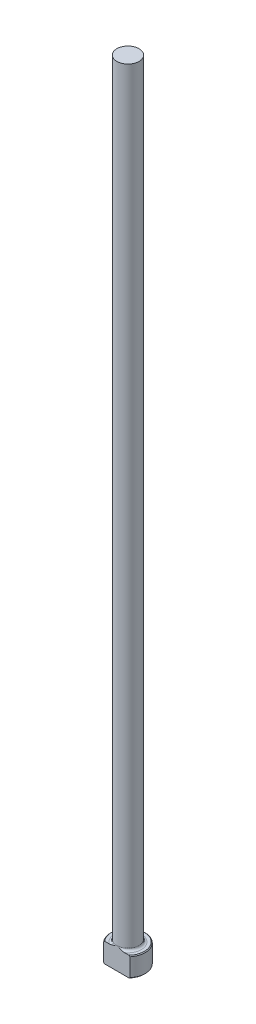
ISO-10303-21;
HEADER;
FILE_DESCRIPTION(('STEP AP214'),'2;1');
FILE_NAME('part.step','',(''),(''),'','','');
FILE_SCHEMA(('AUTOMOTIVE_DESIGN { 1 0 10303 214 1 1 1 1 }'));
ENDSEC;
DATA;
#1=APPLICATION_CONTEXT('core data for automotive mechanical design processes');
#2=APPLICATION_PROTOCOL_DEFINITION('international standard','automotive_design',2000,#1);
#3=PRODUCT_CONTEXT('',#1,'mechanical');
#4=PRODUCT('Part','Part','',(#3));
#5=PRODUCT_RELATED_PRODUCT_CATEGORY('part','',(#4));
#6=PRODUCT_DEFINITION_FORMATION('','',#4);
#7=PRODUCT_DEFINITION_CONTEXT('part definition',#1,'design');
#8=PRODUCT_DEFINITION('design','',#6,#7);
#9=PRODUCT_DEFINITION_SHAPE('','',#8);
#10=(LENGTH_UNIT() NAMED_UNIT(*) SI_UNIT(.MILLI.,.METRE.));
#11=(NAMED_UNIT(*) PLANE_ANGLE_UNIT() SI_UNIT($,.RADIAN.));
#12=(NAMED_UNIT(*) SI_UNIT($,.STERADIAN.) SOLID_ANGLE_UNIT());
#13=UNCERTAINTY_MEASURE_WITH_UNIT(LENGTH_MEASURE(1.E-05),#10,'distance_accuracy_value','');
#14=(GEOMETRIC_REPRESENTATION_CONTEXT(3) GLOBAL_UNCERTAINTY_ASSIGNED_CONTEXT((#13)) GLOBAL_UNIT_ASSIGNED_CONTEXT((#10,
#11,#12)) REPRESENTATION_CONTEXT('',''));
#15=CARTESIAN_POINT('',(0.,0.,0.));
#16=DIRECTION('',(0.,0.,1.));
#17=DIRECTION('',(1.,0.,0.));
#18=AXIS2_PLACEMENT_3D('',#15,#16,#17);
#19=CARTESIAN_POINT('',(0.,0.,0.));
#20=DIRECTION('',(0.,-1.,0.));
#21=DIRECTION('',(0.,0.,-1.));
#22=AXIS2_PLACEMENT_3D('',#19,#20,#21);
#23=PLANE('',#22);
#24=CARTESIAN_POINT('',(0.,0.,0.));
#25=DIRECTION('',(0.,-1.,0.));
#26=DIRECTION('',(0.,0.,-1.));
#27=AXIS2_PLACEMENT_3D('',#24,#25,#26);
#28=CIRCLE('',#27,5.29589999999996);
#29=CARTESIAN_POINT('',(-3.91060119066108,0.,3.57123999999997));
#30=VERTEX_POINT('',#29);
#31=CARTESIAN_POINT('',(3.91060119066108,0.,3.57123999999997));
#32=VERTEX_POINT('',#31);
#33=EDGE_CURVE('E98',#30,#32,#28,.T.);
#34=ORIENTED_EDGE('',*,*,#33,.T.);
#35=DIRECTION('',(-1.,0.,0.));
#36=VECTOR('',#35,1.);
#37=CARTESIAN_POINT('',(-4.24825080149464,0.,3.57123999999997));
#38=LINE('',#37,#36);
#39=EDGE_CURVE('E83',#32,#30,#38,.T.);
#40=ORIENTED_EDGE('',*,*,#39,.T.);
#41=EDGE_LOOP('',(#34,#40));
#42=FACE_BOUND('',#41,.T.);
#43=ADVANCED_FACE('F32',(#42),#23,.T.);
#44=CARTESIAN_POINT('',(0.,259.958771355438,0.));
#45=DIRECTION('',(0.,1.,0.));
#46=DIRECTION('',(0.,0.,1.));
#47=AXIS2_PLACEMENT_3D('',#44,#45,#46);
#48=CYLINDRICAL_SURFACE('',#47,5.54989999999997);
#49=CARTESIAN_POINT('',(0.,6.09600000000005,0.));
#50=DIRECTION('',(0.,1.,0.));
#51=DIRECTION('',(0.,0.,1.));
#52=AXIS2_PLACEMENT_3D('',#49,#50,#51);
#53=CIRCLE('',#52,5.54989999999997);
#54=CARTESIAN_POINT('',(-4.24825080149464,6.09600000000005,3.57123999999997));
#55=VERTEX_POINT('',#54);
#56=CARTESIAN_POINT('',(4.24825080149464,6.09600000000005,3.57123999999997));
#57=VERTEX_POINT('',#56);
#58=EDGE_CURVE('E104',#55,#57,#53,.F.);
#59=ORIENTED_EDGE('',*,*,#58,.T.);
#60=DIRECTION('',(0.,-1.,0.));
#61=VECTOR('',#60,1.);
#62=CARTESIAN_POINT('',(4.24825080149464,254.,3.57123999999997));
#63=LINE('',#62,#61);
#64=CARTESIAN_POINT('',(4.24825080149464,0.253999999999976,3.57123999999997));
#65=VERTEX_POINT('',#64);
#66=EDGE_CURVE('E183',#57,#65,#63,.T.);
#67=ORIENTED_EDGE('',*,*,#66,.T.);
#68=CARTESIAN_POINT('',(0.,0.253999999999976,0.));
#69=DIRECTION('',(0.,-1.,0.));
#70=DIRECTION('',(0.,0.,-1.));
#71=AXIS2_PLACEMENT_3D('',#68,#69,#70);
#72=CIRCLE('',#71,5.54989999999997);
#73=CARTESIAN_POINT('',(-4.24825080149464,0.253999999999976,3.57123999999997));
#74=VERTEX_POINT('',#73);
#75=EDGE_CURVE('E100',#65,#74,#72,.F.);
#76=ORIENTED_EDGE('',*,*,#75,.T.);
#77=DIRECTION('',(0.,-1.,0.));
#78=VECTOR('',#77,1.);
#79=CARTESIAN_POINT('',(-4.24825080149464,254.,3.57123999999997));
#80=LINE('',#79,#78);
#81=EDGE_CURVE('E93',#55,#74,#80,.T.);
#82=ORIENTED_EDGE('',*,*,#81,.F.);
#83=EDGE_LOOP('',(#59,#67,#76,#82));
#84=FACE_BOUND('',#83,.T.);
#85=ADVANCED_FACE('F158',(#84),#48,.T.);
#86=CARTESIAN_POINT('',(-5.54989999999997,6.35,0.));
#87=DIRECTION('',(0.,1.,0.));
#88=DIRECTION('',(0.,0.,1.));
#89=AXIS2_PLACEMENT_3D('',#86,#87,#88);
#90=PLANE('',#89);
#91=CARTESIAN_POINT('',(0.,6.35,0.));
#92=DIRECTION('',(0.,1.,0.));
#93=DIRECTION('',(0.,0.,1.));
#94=AXIS2_PLACEMENT_3D('',#91,#92,#93);
#95=CIRCLE('',#94,5.29590000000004);
#96=CARTESIAN_POINT('',(3.91060119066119,6.35,3.57123999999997));
#97=VERTEX_POINT('',#96);
#98=CARTESIAN_POINT('',(-3.91060119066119,6.35,3.57123999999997));
#99=VERTEX_POINT('',#98);
#100=EDGE_CURVE('E178',#97,#99,#95,.T.);
#101=ORIENTED_EDGE('',*,*,#100,.T.);
#102=DIRECTION('',(1.,0.,0.));
#103=VECTOR('',#102,1.);
#104=CARTESIAN_POINT('',(-5.54989999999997,6.35,3.57123999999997));
#105=LINE('',#104,#103);
#106=CARTESIAN_POINT('',(-2.4542236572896,6.35000000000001,3.57123999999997));
#107=VERTEX_POINT('',#106);
#108=EDGE_CURVE('E57',#99,#107,#105,.T.);
#109=ORIENTED_EDGE('',*,*,#108,.T.);
#110=CARTESIAN_POINT('',(0.,6.35,0.));
#111=DIRECTION('',(0.,1.,0.));
#112=DIRECTION('',(0.,0.,1.));
#113=AXIS2_PLACEMENT_3D('',#110,#111,#112);
#114=CIRCLE('',#113,4.33323999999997);
#115=CARTESIAN_POINT('',(2.45422365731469,6.35000000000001,3.57123999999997));
#116=VERTEX_POINT('',#115);
#117=EDGE_CURVE('E107',#107,#116,#114,.F.);
#118=ORIENTED_EDGE('',*,*,#117,.T.);
#119=EDGE_CURVE('E136',#116,#97,#105,.T.);
#120=ORIENTED_EDGE('',*,*,#119,.T.);
#121=EDGE_LOOP('',(#101,#109,#118,#120));
#122=FACE_BOUND('',#121,.T.);
#123=ADVANCED_FACE('F147',(#122),#90,.T.);
#124=CARTESIAN_POINT('',(0.,6.35000000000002,0.));
#125=DIRECTION('',(0.,-1.,0.));
#126=DIRECTION('',(0.,0.,-1.));
#127=AXIS2_PLACEMENT_3D('',#124,#125,#126);
#128=CONICAL_SURFACE('',#127,5.29590000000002,0.785398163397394);
#129=ORIENTED_EDGE('',*,*,#58,.F.);
#130=CARTESIAN_POINT('',(-9.34862922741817,1.63837165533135,3.57123999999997));
#131=CARTESIAN_POINT('',(-9.20449095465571,1.7730174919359,3.57123999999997));
#132=CARTESIAN_POINT('',(-9.06015748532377,1.90745428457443,3.57123999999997));
#133=CARTESIAN_POINT('',(-8.77103871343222,2.17584295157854,3.57123999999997));
#134=CARTESIAN_POINT('',(-8.62625340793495,2.30979482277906,3.57123999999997));
#135=CARTESIAN_POINT('',(-8.19106245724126,2.71088279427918,3.57123999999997));
#136=CARTESIAN_POINT('',(-7.89988923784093,2.97718811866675,3.57123999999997));
#137=CARTESIAN_POINT('',(-7.31266273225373,3.50875703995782,3.57123999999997));
#138=CARTESIAN_POINT('',(-7.01658928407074,3.77399839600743,3.57123999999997));
#139=CARTESIAN_POINT('',(-6.42070514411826,4.30018345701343,3.57123999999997));
#140=CARTESIAN_POINT('',(-6.12089498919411,4.56112776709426,3.57123999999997));
#141=CARTESIAN_POINT('',(-5.57379517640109,5.02739327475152,3.57123999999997));
#142=CARTESIAN_POINT('',(-5.32743465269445,5.23380250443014,3.57123999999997));
#143=CARTESIAN_POINT('',(-4.82983105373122,5.6408695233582,3.57123999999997));
#144=CARTESIAN_POINT('',(-4.57858641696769,5.84152542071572,3.57123999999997));
#145=CARTESIAN_POINT('',(-4.19689664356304,6.13579820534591,3.57123999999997));
#146=CARTESIAN_POINT('',(-4.06897719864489,6.23268859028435,3.57123999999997));
#147=CARTESIAN_POINT('',(-3.81112388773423,6.42374523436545,3.57123999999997));
#148=CARTESIAN_POINT('',(-3.68119013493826,6.51791164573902,3.57123999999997));
#149=CARTESIAN_POINT('',(-3.41897062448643,6.7027760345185,3.57123999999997));
#150=CARTESIAN_POINT('',(-3.28668612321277,6.7934757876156,3.57123999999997));
#151=CARTESIAN_POINT('',(-3.01922757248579,6.97049297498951,3.57123999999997));
#152=CARTESIAN_POINT('',(-2.88405397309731,7.05681108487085,3.57123999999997));
#153=CARTESIAN_POINT('',(-2.62920774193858,7.21219297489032,3.57123999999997));
#154=CARTESIAN_POINT('',(-2.50998408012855,7.28198981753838,3.57123999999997));
#155=CARTESIAN_POINT('',(-2.26853125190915,7.41625275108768,3.57123999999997));
#156=CARTESIAN_POINT('',(-2.14630175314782,7.48071824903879,3.57123999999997));
#157=CARTESIAN_POINT('',(-1.89852618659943,7.60281435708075,3.57123999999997));
#158=CARTESIAN_POINT('',(-1.77298191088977,7.66044857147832,3.57123999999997));
#159=CARTESIAN_POINT('',(-1.51824567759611,7.76705237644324,3.57123999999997));
#160=CARTESIAN_POINT('',(-1.38905465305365,7.81602416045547,3.57123999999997));
#161=CARTESIAN_POINT('',(-1.15390735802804,7.89415135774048,3.57123999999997));
#162=CARTESIAN_POINT('',(-1.048621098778,7.92531105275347,3.57123999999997));
#163=CARTESIAN_POINT('',(-0.835998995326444,7.97955362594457,3.57123999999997));
#164=CARTESIAN_POINT('',(-0.728663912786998,8.00263944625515,3.57123999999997));
#165=CARTESIAN_POINT('',(-0.512745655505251,8.03960069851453,3.57123999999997));
#166=CARTESIAN_POINT('',(-0.404167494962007,8.05350499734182,3.57123999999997));
#167=CARTESIAN_POINT('',(-0.186191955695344,8.07145854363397,3.57123999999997));
#168=CARTESIAN_POINT('',(-0.0767946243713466,8.07550835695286,3.57123999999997));
#169=CARTESIAN_POINT('',(0.14220663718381,8.07351212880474,3.57123999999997));
#170=CARTESIAN_POINT('',(0.251810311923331,8.06743838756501,3.57123999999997));
#171=CARTESIAN_POINT('',(0.470024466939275,8.0454991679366,3.57123999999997));
#172=CARTESIAN_POINT('',(0.578634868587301,8.02963292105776,3.57123999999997));
#173=CARTESIAN_POINT('',(0.794483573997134,7.98889583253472,3.57123999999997));
#174=CARTESIAN_POINT('',(0.901716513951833,7.96399693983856,3.57123999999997));
#175=CARTESIAN_POINT('',(1.11401362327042,7.9063349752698,3.57123999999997));
#176=CARTESIAN_POINT('',(1.21907768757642,7.87357152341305,3.57123999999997));
#177=CARTESIAN_POINT('',(1.5544253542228,7.75709852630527,3.57123999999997));
#178=CARTESIAN_POINT('',(1.78015988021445,7.66020810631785,3.57123999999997));
#179=CARTESIAN_POINT('',(2.11063839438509,7.49869222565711,3.57123999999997));
#180=CARTESIAN_POINT('',(2.21956521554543,7.44208205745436,3.57123999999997));
#181=CARTESIAN_POINT('',(2.43502073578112,7.32445015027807,3.57123999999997));
#182=CARTESIAN_POINT('',(2.54154973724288,7.26342897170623,3.57123999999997));
#183=CARTESIAN_POINT('',(2.75384117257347,7.13701656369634,3.57123999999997));
#184=CARTESIAN_POINT('',(2.85957563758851,7.0715788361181,3.57123999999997));
#185=CARTESIAN_POINT('',(3.06914141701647,6.93772653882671,3.57123999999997));
#186=CARTESIAN_POINT('',(3.1729726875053,6.86931190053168,3.57123999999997));
#187=CARTESIAN_POINT('',(3.48178799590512,6.66057078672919,3.57123999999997));
#188=CARTESIAN_POINT('',(3.68431418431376,6.51661264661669,3.57123999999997));
#189=CARTESIAN_POINT('',(4.13501059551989,6.18482897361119,3.57123999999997));
#190=CARTESIAN_POINT('',(4.38177575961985,5.99511425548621,3.57123999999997));
#191=CARTESIAN_POINT('',(4.86985386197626,5.60875730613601,3.57123999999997));
#192=CARTESIAN_POINT('',(5.11116579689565,5.41211381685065,3.57123999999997));
#193=CARTESIAN_POINT('',(5.59003172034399,5.01381470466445,3.57123999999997));
#194=CARTESIAN_POINT('',(5.82758147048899,4.81215400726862,3.57123999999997));
#195=CARTESIAN_POINT('',(6.29968686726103,4.40535532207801,3.57123999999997));
#196=CARTESIAN_POINT('',(6.53424243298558,4.20021724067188,3.57123999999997));
#197=CARTESIAN_POINT('',(6.98601923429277,3.80065590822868,3.57123999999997));
#198=CARTESIAN_POINT('',(7.20338349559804,3.60639403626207,3.57123999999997));
#199=CARTESIAN_POINT('',(7.63652694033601,3.21610232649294,3.57123999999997));
#200=CARTESIAN_POINT('',(7.85230608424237,3.02007244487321,3.57123999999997));
#201=CARTESIAN_POINT('',(8.28210401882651,2.62706235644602,3.57123999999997));
#202=CARTESIAN_POINT('',(8.49612567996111,2.43008528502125,3.57123999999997));
#203=CARTESIAN_POINT('',(8.92311188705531,2.03500873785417,3.57123999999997));
#204=CARTESIAN_POINT('',(9.13607648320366,1.83690931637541,3.57123999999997));
#205=CARTESIAN_POINT('',(9.34862922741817,1.63837165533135,3.57123999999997));
#206=B_SPLINE_CURVE_WITH_KNOTS('',3,(#130,#131,#132,#133,#134,#135,#136,#137,#138,#139,#140,
#141,#142,#143,#144,#145,#146,#147,#148,#149,#150,#151,#152,#153,#154,#155,#156,#157,#158,#159,
#160,#161,#162,#163,#164,#165,#166,#167,#168,#169,#170,#171,#172,#173,#174,#175,#176,#177,#178,
#179,#180,#181,#182,#183,#184,#185,#186,#187,#188,#189,#190,#191,#192,#193,#194,#195,#196,#197,
#198,#199,#200,#201,#202,#203,#204,#205),.UNSPECIFIED.,.F.,.F.,(4,2,2,2,2,2,2,2,2,2,2,2,2,2,2,2,
2,2,2,2,2,2,2,2,2,2,2,2,2,2,2,2,2,2,2,2,2,4),(0.,0.591732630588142,1.18346911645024,
2.36721926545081,3.55971708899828,4.75204551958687,5.7161943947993,6.68065676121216,
7.16204440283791,7.64340508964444,8.12451581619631,8.60555213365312,9.01990095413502,
9.43429579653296,9.84847101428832,10.2625412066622,10.5916729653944,10.9206846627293,
11.2486569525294,11.5766104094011,11.9054626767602,12.2343407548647,12.5642490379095,
12.8941732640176,13.628955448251,13.9971988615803,14.3653955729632,14.7383788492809,
15.1113707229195,15.8565801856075,16.7901898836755,17.7239699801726,18.6587363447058,
19.5935279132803,20.4680812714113,21.3426563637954,22.215261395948,23.0878245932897),.UNSPECIFIED.);
#207=EDGE_CURVE('E135',#55,#99,#206,.T.);
#208=ORIENTED_EDGE('',*,*,#207,.T.);
#209=ORIENTED_EDGE('',*,*,#100,.F.);
#210=EDGE_CURVE('E127',#97,#57,#206,.T.);
#211=ORIENTED_EDGE('',*,*,#210,.T.);
#212=EDGE_LOOP('',(#129,#208,#209,#211));
#213=FACE_BOUND('',#212,.T.);
#214=ADVANCED_FACE('F143',(#213),#128,.T.);
#215=CARTESIAN_POINT('',(0.,0.253999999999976,0.));
#216=DIRECTION('',(0.,1.,0.));
#217=DIRECTION('',(0.,0.,1.));
#218=AXIS2_PLACEMENT_3D('',#215,#216,#217);
#219=CONICAL_SURFACE('',#218,5.54989999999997,0.785398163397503);
#220=ORIENTED_EDGE('',*,*,#75,.F.);
#221=CARTESIAN_POINT('',(9.34862922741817,4.7116283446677,3.57123999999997));
#222=CARTESIAN_POINT('',(9.20449095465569,4.57698250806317,3.57123999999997));
#223=CARTESIAN_POINT('',(9.06015748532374,4.44254571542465,3.57123999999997));
#224=CARTESIAN_POINT('',(8.77103871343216,4.17415704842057,3.57123999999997));
#225=CARTESIAN_POINT('',(8.62625340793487,4.04020517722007,3.57123999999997));
#226=CARTESIAN_POINT('',(8.19106245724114,3.63911720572,3.57123999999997));
#227=CARTESIAN_POINT('',(7.89988923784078,3.37281188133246,3.57123999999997));
#228=CARTESIAN_POINT('',(7.31266273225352,2.84124296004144,3.57123999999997));
#229=CARTESIAN_POINT('',(7.01658928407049,2.57600160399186,3.57123999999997));
#230=CARTESIAN_POINT('',(6.42070514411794,2.04981654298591,3.57123999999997));
#231=CARTESIAN_POINT('',(6.12089498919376,1.78887223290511,3.57123999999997));
#232=CARTESIAN_POINT('',(5.57379517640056,1.32260672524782,3.57123999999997));
#233=CARTESIAN_POINT('',(5.32743465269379,1.11619749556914,3.57123999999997));
#234=CARTESIAN_POINT('',(4.82983105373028,0.709130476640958,3.57123999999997));
#235=CARTESIAN_POINT('',(4.5785864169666,0.508474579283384,3.57123999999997));
#236=CARTESIAN_POINT('',(4.19689664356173,0.214201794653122,3.57123999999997));
#237=CARTESIAN_POINT('',(4.06897719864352,0.117311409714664,3.57123999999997));
#238=CARTESIAN_POINT('',(3.8111238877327,-0.0737452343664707,3.57123999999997));
#239=CARTESIAN_POINT('',(3.68119013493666,-0.167911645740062,3.57123999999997));
#240=CARTESIAN_POINT('',(3.41897062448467,-0.352776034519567,3.57123999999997));
#241=CARTESIAN_POINT('',(3.28668612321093,-0.443475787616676,3.57123999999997));
#242=CARTESIAN_POINT('',(3.01922757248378,-0.620492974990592,3.57123999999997));
#243=CARTESIAN_POINT('',(2.88405397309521,-0.706811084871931,3.57123999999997));
#244=CARTESIAN_POINT('',(2.6292077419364,-0.86219297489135,3.57123999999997));
#245=CARTESIAN_POINT('',(2.50998408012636,-0.931989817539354,3.57123999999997));
#246=CARTESIAN_POINT('',(2.26853125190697,-1.06625275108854,3.57123999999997));
#247=CARTESIAN_POINT('',(2.14630175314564,-1.13071824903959,3.57123999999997));
#248=CARTESIAN_POINT('',(1.89852618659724,-1.25281435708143,3.57123999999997));
#249=CARTESIAN_POINT('',(1.77298191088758,-1.31044857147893,3.57123999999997));
#250=CARTESIAN_POINT('',(1.51824567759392,-1.41705237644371,3.57123999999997));
#251=CARTESIAN_POINT('',(1.38905465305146,-1.46602416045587,3.57123999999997));
#252=CARTESIAN_POINT('',(1.15390735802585,-1.54415135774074,3.57123999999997));
#253=CARTESIAN_POINT('',(1.04862109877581,-1.57531105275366,3.57123999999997));
#254=CARTESIAN_POINT('',(0.835998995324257,-1.62955362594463,3.57123999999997));
#255=CARTESIAN_POINT('',(0.728663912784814,-1.65263944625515,3.57123999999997));
#256=CARTESIAN_POINT('',(0.512745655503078,-1.68960069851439,3.57123999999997));
#257=CARTESIAN_POINT('',(0.404167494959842,-1.70350499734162,3.57123999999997));
#258=CARTESIAN_POINT('',(0.186191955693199,-1.72145854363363,3.57123999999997));
#259=CARTESIAN_POINT('',(0.0767946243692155,-1.72550835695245,3.57123999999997));
#260=CARTESIAN_POINT('',(-0.142206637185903,-1.7235121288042,3.57123999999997));
#261=CARTESIAN_POINT('',(-0.251810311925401,-1.71743838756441,3.57123999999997));
#262=CARTESIAN_POINT('',(-0.470024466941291,-1.69549916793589,3.57123999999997));
#263=CARTESIAN_POINT('',(-0.578634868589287,-1.679632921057,3.57123999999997));
#264=CARTESIAN_POINT('',(-0.794483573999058,-1.63889583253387,3.57123999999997));
#265=CARTESIAN_POINT('',(-0.901716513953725,-1.61399693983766,3.57123999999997));
#266=CARTESIAN_POINT('',(-1.11401362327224,-1.55633497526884,3.57123999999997));
#267=CARTESIAN_POINT('',(-1.21907768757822,-1.52357152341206,3.57123999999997));
#268=CARTESIAN_POINT('',(-1.55442535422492,-1.40709852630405,3.57123999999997));
#269=CARTESIAN_POINT('',(-1.78015988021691,-1.3102081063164,3.57123999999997));
#270=CARTESIAN_POINT('',(-2.11063839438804,-1.14869222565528,3.57123999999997));
#271=CARTESIAN_POINT('',(-2.21956521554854,-1.09208205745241,3.57123999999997));
#272=CARTESIAN_POINT('',(-2.43502073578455,-0.974450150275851,3.57123999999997));
#273=CARTESIAN_POINT('',(-2.54154973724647,-0.913428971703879,3.57123999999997));
#274=CARTESIAN_POINT('',(-2.75384117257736,-0.787016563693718,3.57123999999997));
#275=CARTESIAN_POINT('',(-2.85957563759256,-0.721578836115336,3.57123999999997));
#276=CARTESIAN_POINT('',(-3.06914141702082,-0.58772653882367,3.57123999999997));
#277=CARTESIAN_POINT('',(-3.1729726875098,-0.519311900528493,3.57123999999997));
#278=CARTESIAN_POINT('',(-3.48178799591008,-0.310570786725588,3.57123999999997));
#279=CARTESIAN_POINT('',(-3.68431418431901,-0.166612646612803,3.57123999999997));
#280=CARTESIAN_POINT('',(-4.13501059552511,0.165171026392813,3.57123999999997));
#281=CARTESIAN_POINT('',(-4.38177575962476,0.354885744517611,3.57123999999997));
#282=CARTESIAN_POINT('',(-4.86985386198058,0.741242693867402,3.57123999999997));
#283=CARTESIAN_POINT('',(-5.11116579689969,0.937886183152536,3.57123999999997));
#284=CARTESIAN_POINT('',(-5.59003172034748,1.33618529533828,3.57123999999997));
#285=CARTESIAN_POINT('',(-5.8275814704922,1.53784599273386,3.57123999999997));
#286=CARTESIAN_POINT('',(-6.29968686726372,1.94464467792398,3.57123999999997));
#287=CARTESIAN_POINT('',(-6.534242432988,2.14978275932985,3.57123999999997));
#288=CARTESIAN_POINT('',(-6.98601923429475,2.5493440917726,3.57123999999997));
#289=CARTESIAN_POINT('',(-7.20338349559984,2.74360596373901,3.57123999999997));
#290=CARTESIAN_POINT('',(-7.63652694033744,3.13389767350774,3.57123999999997));
#291=CARTESIAN_POINT('',(-7.85230608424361,3.32992755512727,3.57123999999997));
#292=CARTESIAN_POINT('',(-8.28210401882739,3.72293764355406,3.57123999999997));
#293=CARTESIAN_POINT('',(-8.49612567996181,3.91991471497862,3.57123999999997));
#294=CARTESIAN_POINT('',(-8.92311188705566,4.31499126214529,3.57123999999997));
#295=CARTESIAN_POINT('',(-9.13607648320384,4.51309068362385,3.57123999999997));
#296=CARTESIAN_POINT('',(-9.34862922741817,4.7116283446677,3.57123999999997));
#297=B_SPLINE_CURVE_WITH_KNOTS('',3,(#221,#222,#223,#224,#225,#226,#227,#228,#229,#230,#231,
#232,#233,#234,#235,#236,#237,#238,#239,#240,#241,#242,#243,#244,#245,#246,#247,#248,#249,#250,
#251,#252,#253,#254,#255,#256,#257,#258,#259,#260,#261,#262,#263,#264,#265,#266,#267,#268,#269,
#270,#271,#272,#273,#274,#275,#276,#277,#278,#279,#280,#281,#282,#283,#284,#285,#286,#287,#288,
#289,#290,#291,#292,#293,#294,#295,#296),.UNSPECIFIED.,.F.,.F.,(4,2,2,2,2,2,2,2,2,2,2,2,2,2,2,2,
2,2,2,2,2,2,2,2,2,2,2,2,2,2,2,2,2,2,2,2,2,4),(0.,0.591732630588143,1.18346911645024,
2.36721926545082,3.55971708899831,4.75204551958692,5.71619439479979,6.68065676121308,
7.16204440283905,7.64340508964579,8.12451581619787,8.6055521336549,9.01990095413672,
9.43429579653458,9.84847101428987,10.2625412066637,10.5916729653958,10.9206846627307,
11.2486569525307,11.5766104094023,11.9054626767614,12.2343407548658,12.5642490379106,
12.8941732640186,13.6289554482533,13.9971988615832,14.3653955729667,14.7383788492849,
15.1113707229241,15.8565801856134,16.7901898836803,17.7239699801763,18.6587363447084,
19.5935279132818,20.4680812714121,21.3426563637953,22.2152613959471,23.087824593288),.UNSPECIFIED.);
#298=EDGE_CURVE('E86',#65,#32,#297,.T.);
#299=ORIENTED_EDGE('',*,*,#298,.T.);
#300=ORIENTED_EDGE('',*,*,#33,.F.);
#301=EDGE_CURVE('E89',#30,#74,#297,.T.);
#302=ORIENTED_EDGE('',*,*,#301,.T.);
#303=EDGE_LOOP('',(#220,#299,#300,#302));
#304=FACE_BOUND('',#303,.T.);
#305=ADVANCED_FACE('F97',(#304),#219,.T.);
#306=CARTESIAN_POINT('',(0.,7.11200000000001,0.));
#307=DIRECTION('',(0.,1.,0.));
#308=DIRECTION('',(0.,0.,1.));
#309=AXIS2_PLACEMENT_3D('',#306,#307,#308);
#310=TOROIDAL_SURFACE('',#309,4.33323999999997,0.762);
#311=CARTESIAN_POINT('',(0.,7.11200000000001,3.57123999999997));
#312=CARTESIAN_POINT('',(-5.01521697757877E-13,7.11200100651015,3.57123999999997));
#313=CARTESIAN_POINT('',(1.76590739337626E-07,7.11200201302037,3.57123999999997));
#314=CARTESIAN_POINT('',(7.55286765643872E-07,7.11200396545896,3.57123999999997));
#315=CARTESIAN_POINT('',(1.16131545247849E-06,7.11200491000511,3.57123999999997));
#316=CARTESIAN_POINT('',(2.14347150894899E-06,7.1120067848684,3.57123999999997));
#317=CARTESIAN_POINT('',(2.72908456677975E-06,7.1120077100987,3.57123999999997));
#318=CARTESIAN_POINT('',(4.00559807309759E-06,7.11200947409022,3.57123999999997));
#319=CARTESIAN_POINT('',(4.69593042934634E-06,7.11201031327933,3.57123999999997));
#320=CARTESIAN_POINT('',(7.12798779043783E-06,7.1120130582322,3.57123999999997));
#321=CARTESIAN_POINT('',(9.00885578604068E-06,7.11201484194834,3.57123999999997));
#322=CARTESIAN_POINT('',(1.29410398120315E-05,7.11201807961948,3.57123999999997));
#323=CARTESIAN_POINT('',(1.49866128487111E-05,7.11201954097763,3.57123999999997));
#324=CARTESIAN_POINT('',(2.27853159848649E-05,7.11202486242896,3.57123999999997));
#325=CARTESIAN_POINT('',(2.87443387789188E-05,7.11202843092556,3.57123999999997));
#326=CARTESIAN_POINT('',(4.06410352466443E-05,7.11203442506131,3.57123999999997));
#327=CARTESIAN_POINT('',(4.65470368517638E-05,7.11203691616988,3.57123999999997));
#328=CARTESIAN_POINT('',(7.11711037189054E-05,7.11204719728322,3.57123999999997));
#329=CARTESIAN_POINT('',(8.99605831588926E-05,7.11205478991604,3.57123999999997));
#330=CARTESIAN_POINT('',(0.00012545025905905,7.11206727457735,3.57123999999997));
#331=CARTESIAN_POINT('',(0.000142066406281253,7.1120723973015,3.57123999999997));
#332=CARTESIAN_POINT('',(0.000260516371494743,7.11211213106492,3.57123999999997));
#333=CARTESIAN_POINT('',(0.00035660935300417,7.1121616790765,3.57123999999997));
#334=CARTESIAN_POINT('',(0.000727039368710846,7.1123455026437,3.57123999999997));
#335=CARTESIAN_POINT('',(0.001005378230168,7.11246868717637,3.57123999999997));
#336=CARTESIAN_POINT('',(0.00207465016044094,7.11294918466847,3.57123999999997));
#337=CARTESIAN_POINT('',(0.00286145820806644,7.11331811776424,3.57123999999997));
#338=CARTESIAN_POINT('',(0.00604597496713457,7.11480388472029,3.57123999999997));
#339=CARTESIAN_POINT('',(0.00844825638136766,7.11590763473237,3.57123999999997));
#340=CARTESIAN_POINT('',(0.0421206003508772,7.13138817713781,3.57123999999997));
#341=CARTESIAN_POINT('',(0.0733565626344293,7.1458632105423,3.57123999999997));
#342=CARTESIAN_POINT('',(0.136296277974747,7.1749208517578,3.57123999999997));
#343=CARTESIAN_POINT('',(0.168000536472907,7.18950218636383,3.57123999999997));
#344=CARTESIAN_POINT('',(0.26049771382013,7.23192483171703,3.57123999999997));
#345=CARTESIAN_POINT('',(0.321333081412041,7.2596772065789,3.57123999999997));
#346=CARTESIAN_POINT('',(0.450063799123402,7.3176989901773,3.57123999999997));
#347=CARTESIAN_POINT('',(0.517988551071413,7.34790319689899,3.57123999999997));
#348=CARTESIAN_POINT('',(0.654961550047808,7.40755967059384,3.57123999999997));
#349=CARTESIAN_POINT('',(0.724014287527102,7.4370016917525,3.57123999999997));
#350=CARTESIAN_POINT('',(0.845579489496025,7.48730903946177,3.57123999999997));
#351=CARTESIAN_POINT('',(0.897958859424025,7.5084946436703,3.57123999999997));
#352=CARTESIAN_POINT('',(1.00299625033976,7.54979079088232,3.57123999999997));
#353=CARTESIAN_POINT('',(1.05565332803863,7.56990374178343,3.57123999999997));
#354=CARTESIAN_POINT('',(1.21212759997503,7.62761302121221,3.57123999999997));
#355=CARTESIAN_POINT('',(1.31659809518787,7.66348622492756,3.57123999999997));
#356=CARTESIAN_POINT('',(1.49278330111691,7.71807663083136,3.57123999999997));
#357=CARTESIAN_POINT('',(1.56395183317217,7.73855254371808,3.57123999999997));
#358=CARTESIAN_POINT('',(1.70759150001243,7.77611793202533,3.57123999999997));
#359=CARTESIAN_POINT('',(1.78006754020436,7.79318887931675,3.57123999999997));
#360=CARTESIAN_POINT('',(1.9296081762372,7.82384868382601,3.57123999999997));
#361=CARTESIAN_POINT('',(2.00671897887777,7.83721686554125,3.57123999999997));
#362=CARTESIAN_POINT('',(2.16170557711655,7.85827154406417,3.57123999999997));
#363=CARTESIAN_POINT('',(2.23958110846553,7.86595993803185,3.57123999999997));
#364=CARTESIAN_POINT('',(2.41316458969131,7.87541912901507,3.57123999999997));
#365=CARTESIAN_POINT('',(2.50897971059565,7.87548974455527,3.57123999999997));
#366=CARTESIAN_POINT('',(2.69873879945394,7.86266617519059,3.57123999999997));
#367=CARTESIAN_POINT('',(2.79269122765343,7.84993298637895,3.57123999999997));
#368=CARTESIAN_POINT('',(2.94834629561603,7.81478970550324,3.57123999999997));
#369=CARTESIAN_POINT('',(3.01099313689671,7.79661956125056,3.57123999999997));
#370=CARTESIAN_POINT('',(3.13311783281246,7.75119466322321,3.57123999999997));
#371=CARTESIAN_POINT('',(3.19259303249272,7.72393243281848,3.57123999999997));
#372=CARTESIAN_POINT('',(3.2895229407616,7.66822810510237,3.57123999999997));
#373=CARTESIAN_POINT('',(3.32843006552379,7.64232613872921,3.57123999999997));
#374=CARTESIAN_POINT('',(3.40175541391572,7.58480019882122,3.57123999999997));
#375=CARTESIAN_POINT('',(3.43618193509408,7.55318706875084,3.57123999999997));
#376=CARTESIAN_POINT('',(3.49199473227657,7.49158316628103,3.57123999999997));
#377=CARTESIAN_POINT('',(3.5145944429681,7.4626970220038,3.57123999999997));
#378=CARTESIAN_POINT('',(3.55479974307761,7.40160169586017,3.57123999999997));
#379=CARTESIAN_POINT('',(3.57240720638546,7.36939376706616,3.57123999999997));
#380=CARTESIAN_POINT('',(3.60162953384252,7.30200115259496,3.57123999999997));
#381=CARTESIAN_POINT('',(3.61319239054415,7.26679356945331,3.57123999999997));
#382=CARTESIAN_POINT('',(3.62914546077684,7.19478844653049,3.57123999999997));
#383=CARTESIAN_POINT('',(3.63354215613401,7.15799237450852,3.57123999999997));
#384=CARTESIAN_POINT('',(3.6347021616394,7.08938239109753,3.57123999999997));
#385=CARTESIAN_POINT('',(3.63243477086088,7.05758138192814,3.57123999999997));
#386=CARTESIAN_POINT('',(3.62246065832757,6.99485289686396,3.57123999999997));
#387=CARTESIAN_POINT('',(3.614754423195,6.96392534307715,3.57123999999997));
#388=CARTESIAN_POINT('',(3.59460534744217,6.90439360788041,3.57123999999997));
#389=CARTESIAN_POINT('',(3.5822644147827,6.87575447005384,3.57123999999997));
#390=CARTESIAN_POINT('',(3.55348648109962,6.82063145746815,3.57123999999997));
#391=CARTESIAN_POINT('',(3.53704806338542,6.79414833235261,3.57123999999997));
#392=CARTESIAN_POINT('',(3.49338312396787,6.73337952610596,3.57123999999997));
#393=CARTESIAN_POINT('',(3.4644863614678,6.70029184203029,3.57123999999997));
#394=CARTESIAN_POINT('',(3.40170527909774,6.63922321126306,3.57123999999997));
#395=CARTESIAN_POINT('',(3.3678091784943,6.61125468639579,3.57123999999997));
#396=CARTESIAN_POINT('',(3.28195465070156,6.54991490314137,3.57123999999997));
#397=CARTESIAN_POINT('',(3.22826146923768,6.51898089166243,3.57123999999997));
#398=CARTESIAN_POINT('',(3.11685649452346,6.4659881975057,3.57123999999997));
#399=CARTESIAN_POINT('',(3.05914651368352,6.44392554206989,3.57123999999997));
#400=CARTESIAN_POINT('',(2.90895675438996,6.397325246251,3.57123999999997));
#401=CARTESIAN_POINT('',(2.81483745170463,6.37812048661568,3.57123999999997));
#402=CARTESIAN_POINT('',(2.62379203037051,6.35393265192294,3.57123999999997));
#403=CARTESIAN_POINT('',(2.52684524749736,6.34914127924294,3.57123999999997));
#404=CARTESIAN_POINT('',(2.34175764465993,6.35101691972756,3.57123999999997));
#405=CARTESIAN_POINT('',(2.25359864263,6.35670506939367,3.57123999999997));
#406=CARTESIAN_POINT('',(2.07796266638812,6.37582328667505,3.57123999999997));
#407=CARTESIAN_POINT('',(1.99048774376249,6.38927124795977,3.57123999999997));
#408=CARTESIAN_POINT('',(1.82119356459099,6.42156125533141,3.57123999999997));
#409=CARTESIAN_POINT('',(1.73931346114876,6.4400930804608,3.57123999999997));
#410=CARTESIAN_POINT('',(1.57721134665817,6.48159818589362,3.57123999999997));
#411=CARTESIAN_POINT('',(1.4969824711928,6.50454506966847,3.57123999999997));
#412=CARTESIAN_POINT('',(1.31237017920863,6.56193110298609,3.57123999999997));
#413=CARTESIAN_POINT('',(1.20840446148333,6.59770595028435,3.57123999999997));
#414=CARTESIAN_POINT('',(1.05265881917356,6.6552295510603,3.57123999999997));
#415=CARTESIAN_POINT('',(1.00023402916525,6.67527678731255,3.57123999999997));
#416=CARTESIAN_POINT('',(0.895657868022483,6.71642939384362,3.57123999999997));
#417=CARTESIAN_POINT('',(0.843507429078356,6.7375371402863,3.57123999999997));
#418=CARTESIAN_POINT('',(0.7223348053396,6.78770883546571,3.57123999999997));
#419=CARTESIAN_POINT('',(0.653445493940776,6.81709241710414,3.57123999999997));
#420=CARTESIAN_POINT('',(0.516794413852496,6.87662522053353,3.57123999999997));
#421=CARTESIAN_POINT('',(0.449028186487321,6.90676427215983,3.57123999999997));
#422=CARTESIAN_POINT('',(0.320599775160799,6.96465641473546,3.57123999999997));
#423=CARTESIAN_POINT('',(0.25990837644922,6.99234472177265,3.57123999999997));
#424=CARTESIAN_POINT('',(0.167629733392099,7.03466840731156,3.57123999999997));
#425=CARTESIAN_POINT('',(0.136000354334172,7.04921552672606,3.57123999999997));
#426=CARTESIAN_POINT('',(0.0732091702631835,7.07820481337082,3.57123999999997));
#427=CARTESIAN_POINT('',(0.0420468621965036,7.09264571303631,3.57123999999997));
#428=CARTESIAN_POINT('',(0.00844824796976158,7.10809236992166,3.57123999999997));
#429=CARTESIAN_POINT('',(0.00604595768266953,7.10919612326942,3.57123999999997));
#430=CARTESIAN_POINT('',(0.00286143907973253,7.11068189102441,3.57123999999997));
#431=CARTESIAN_POINT('',(0.00207463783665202,7.11105082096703,3.57123999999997));
#432=CARTESIAN_POINT('',(0.00100537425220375,7.11153131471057,3.57123999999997));
#433=CARTESIAN_POINT('',(0.000727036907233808,7.11165449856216,3.57123999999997));
#434=CARTESIAN_POINT('',(0.000356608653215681,7.11183832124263,3.57123999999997));
#435=CARTESIAN_POINT('',(0.000260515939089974,7.11188786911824,3.57123999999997));
#436=CARTESIAN_POINT('',(0.000142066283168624,7.1119276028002,3.57123999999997));
#437=CARTESIAN_POINT('',(0.000125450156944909,7.1119327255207,3.57123999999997));
#438=CARTESIAN_POINT('',(8.99605261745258E-05,7.1119452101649,3.57123999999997));
#439=CARTESIAN_POINT('',(7.11710702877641E-05,7.11195280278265,3.57123999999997));
#440=CARTESIAN_POINT('',(4.65470297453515E-05,7.11196308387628,3.57123999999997));
#441=CARTESIAN_POINT('',(4.06410314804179E-05,7.11196557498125,3.57123999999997));
#442=CARTESIAN_POINT('',(2.87443410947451E-05,7.11197156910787,3.57123999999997));
#443=CARTESIAN_POINT('',(2.27853209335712E-05,7.11197513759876,3.57123999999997));
#444=CARTESIAN_POINT('',(1.49866201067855E-05,7.11198045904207,3.57123999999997));
#445=CARTESIAN_POINT('',(1.29410472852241E-05,7.11198192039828,3.57123999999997));
#446=CARTESIAN_POINT('',(9.00886329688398E-06,7.11198515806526,3.57123999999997));
#447=CARTESIAN_POINT('',(7.12799510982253E-06,7.11198694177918,3.57123999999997));
#448=CARTESIAN_POINT('',(4.69593701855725E-06,7.11198968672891,3.57123999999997));
#449=CARTESIAN_POINT('',(4.00560436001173E-06,7.11199052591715,3.57123999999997));
#450=CARTESIAN_POINT('',(2.72909009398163E-06,7.1119922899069,3.57123999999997));
#451=CARTESIAN_POINT('',(2.1434765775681E-06,7.11199321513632,3.57123999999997));
#452=CARTESIAN_POINT('',(1.16131942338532E-06,7.11199508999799,3.57123999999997));
#453=CARTESIAN_POINT('',(7.55290113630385E-07,7.11199603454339,3.57123999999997));
#454=CARTESIAN_POINT('',(1.76592600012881E-07,7.11199798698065,3.57123999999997));
#455=CARTESIAN_POINT('',(5.01521491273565E-13,7.11199899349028,3.57123999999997));
#456=CARTESIAN_POINT('',(0.,7.11200000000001,3.57123999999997));
#457=B_SPLINE_CURVE_WITH_KNOTS('',3,(#311,#312,#313,#314,#315,#316,#317,#318,#319,#320,#321,
#322,#323,#324,#325,#326,#327,#328,#329,#330,#331,#332,#333,#334,#335,#336,#337,#338,#339,#340,
#341,#342,#343,#344,#345,#346,#347,#348,#349,#350,#351,#352,#353,#354,#355,#356,#357,#358,#359,
#360,#361,#362,#363,#364,#365,#366,#367,#368,#369,#370,#371,#372,#373,#374,#375,#376,#377,#378,
#379,#380,#381,#382,#383,#384,#385,#386,#387,#388,#389,#390,#391,#392,#393,#394,#395,#396,#397,
#398,#399,#400,#401,#402,#403,#404,#405,#406,#407,#408,#409,#410,#411,#412,#413,#414,#415,#416,
#417,#418,#419,#420,#421,#422,#423,#424,#425,#426,#427,#428,#429,#430,#431,#432,#433,#434,#435,
#436,#437,#438,#439,#440,#441,#442,#443,#444,#445,#446,#447,#448,#449,#450,#451,#452,#453,#454,
#455,#456),.UNSPECIFIED.,.T.,.F.,(4,2,2,2,2,2,2,2,2,2,2,2,2,2,2,2,2,2,2,2,2,2,2,2,2,2,2,2,2,2,2,
2,2,2,2,2,2,2,2,2,2,2,2,2,2,2,2,2,2,2,2,2,2,2,2,2,2,2,2,2,2,2,2,2,2,2,2,2,2,2,2,2,4),(0.,
3.01651081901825E-06,6.08624378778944E-06,9.35931319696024E-06,1.26152227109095E-05,
2.03532375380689E-05,2.7888914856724E-05,4.86506907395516E-05,6.78612044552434E-05,
0.000128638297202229,0.000180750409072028,0.000503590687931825,0.00141793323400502,
0.00402347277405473,0.0119561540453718,0.115223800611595,0.219916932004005,0.420513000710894,
0.643520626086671,0.868709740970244,1.03820414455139,1.20730049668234,1.53849757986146,
1.76059439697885,1.98386862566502,2.21847368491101,2.4530003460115,2.7397818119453,
3.02300180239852,3.2181586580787,3.41347639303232,3.55325142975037,3.69276382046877,
3.802373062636,3.91194110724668,4.02243696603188,4.13283282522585,4.22800054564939,
4.32315975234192,4.41633865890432,4.5095498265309,4.64060787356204,4.77197983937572,
4.95684440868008,5.14162609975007,5.42820856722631,5.718586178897,5.98320177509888,
6.24843001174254,6.5001259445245,6.75036135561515,7.08003897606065,7.24841369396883,
7.41718413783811,7.64185359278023,7.86434732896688,8.0644706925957,8.1689168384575,
8.27194098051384,8.27987369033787,8.28247920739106,8.28339354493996,8.28371638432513,
8.28376849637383,8.28382927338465,8.28384848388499,8.28386924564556,8.28387678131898,
8.2838845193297,8.28388777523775,8.28389104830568,8.28389411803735,8.28389713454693),.UNSPECIFIED.);
#458=CARTESIAN_POINT('',(0.,7.11200000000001,3.57123999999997));
#459=VERTEX_POINT('',#458);
#460=EDGE_CURVE('E11',#116,#459,#457,.T.);
#461=ORIENTED_EDGE('',*,*,#460,.F.);
#462=ORIENTED_EDGE('',*,*,#117,.F.);
#463=CARTESIAN_POINT('',(0.,7.11200000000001,3.57123999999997));
#464=CARTESIAN_POINT('',(5.01568419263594E-13,7.11199899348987,3.57123999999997));
#465=CARTESIAN_POINT('',(-1.76590739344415E-07,7.11199798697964,3.57123999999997));
#466=CARTESIAN_POINT('',(-7.55286765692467E-07,7.11199603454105,3.57123999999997));
#467=CARTESIAN_POINT('',(-1.16131545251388E-06,7.1119950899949,3.57123999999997));
#468=CARTESIAN_POINT('',(-2.14347150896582E-06,7.11199321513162,3.57123999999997));
#469=CARTESIAN_POINT('',(-2.72908456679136E-06,7.11199228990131,3.57123999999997));
#470=CARTESIAN_POINT('',(-4.00559807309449E-06,7.1119905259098,3.57123999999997));
#471=CARTESIAN_POINT('',(-4.69593042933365E-06,7.11198968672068,3.57123999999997));
#472=CARTESIAN_POINT('',(-7.12798779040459E-06,7.11198694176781,3.57123999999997));
#473=CARTESIAN_POINT('',(-9.00885578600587E-06,7.11198515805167,3.57123999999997));
#474=CARTESIAN_POINT('',(-1.29410398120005E-05,7.11198192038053,3.57123999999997));
#475=CARTESIAN_POINT('',(-1.49866128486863E-05,7.11198045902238,3.57123999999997));
#476=CARTESIAN_POINT('',(-2.27853159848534E-05,7.11197513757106,3.57123999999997));
#477=CARTESIAN_POINT('',(-2.87443387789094E-05,7.11197156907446,3.57123999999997));
#478=CARTESIAN_POINT('',(-4.06410352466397E-05,7.11196557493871,3.57123999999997));
#479=CARTESIAN_POINT('',(-4.65470368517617E-05,7.11196308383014,3.57123999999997));
#480=CARTESIAN_POINT('',(-7.11711037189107E-05,7.11195280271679,3.57123999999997));
#481=CARTESIAN_POINT('',(-8.99605831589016E-05,7.11194521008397,3.57123999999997));
#482=CARTESIAN_POINT('',(-0.000125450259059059,7.11193272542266,3.57123999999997));
#483=CARTESIAN_POINT('',(-0.000142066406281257,7.11192760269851,3.57123999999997));
#484=CARTESIAN_POINT('',(-0.000260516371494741,7.11188786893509,3.57123999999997));
#485=CARTESIAN_POINT('',(-0.00035660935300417,7.11183832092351,3.57123999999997));
#486=CARTESIAN_POINT('',(-0.000727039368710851,7.11165449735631,3.57123999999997));
#487=CARTESIAN_POINT('',(-0.001005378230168,7.11153131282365,3.57123999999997));
#488=CARTESIAN_POINT('',(-0.00207465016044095,7.11105081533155,3.57123999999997));
#489=CARTESIAN_POINT('',(-0.00286145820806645,7.11068188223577,3.57123999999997));
#490=CARTESIAN_POINT('',(-0.00604597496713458,7.10919611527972,3.57123999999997));
#491=CARTESIAN_POINT('',(-0.00844825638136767,7.10809236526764,3.57123999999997));
#492=CARTESIAN_POINT('',(-0.0421206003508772,7.0926118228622,3.57123999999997));
#493=CARTESIAN_POINT('',(-0.0733565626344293,7.07813678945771,3.57123999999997));
#494=CARTESIAN_POINT('',(-0.136296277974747,7.04907914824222,3.57123999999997));
#495=CARTESIAN_POINT('',(-0.168000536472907,7.03449781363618,3.57123999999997));
#496=CARTESIAN_POINT('',(-0.26049771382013,6.99207516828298,3.57123999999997));
#497=CARTESIAN_POINT('',(-0.321333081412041,6.96432279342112,3.57123999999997));
#498=CARTESIAN_POINT('',(-0.450063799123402,6.90630100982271,3.57123999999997));
#499=CARTESIAN_POINT('',(-0.517988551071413,6.87609680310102,3.57123999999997));
#500=CARTESIAN_POINT('',(-0.654961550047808,6.81644032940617,3.57123999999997));
#501=CARTESIAN_POINT('',(-0.724014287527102,6.78699830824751,3.57123999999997));
#502=CARTESIAN_POINT('',(-0.845579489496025,6.73669096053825,3.57123999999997));
#503=CARTESIAN_POINT('',(-0.897958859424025,6.71550535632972,3.57123999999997));
#504=CARTESIAN_POINT('',(-1.00299625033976,6.67420920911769,3.57123999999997));
#505=CARTESIAN_POINT('',(-1.05565332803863,6.65409625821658,3.57123999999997));
#506=CARTESIAN_POINT('',(-1.21212759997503,6.59638697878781,3.57123999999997));
#507=CARTESIAN_POINT('',(-1.31659809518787,6.56051377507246,3.57123999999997));
#508=CARTESIAN_POINT('',(-1.49278330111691,6.50592336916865,3.57123999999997));
#509=CARTESIAN_POINT('',(-1.56395183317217,6.48544745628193,3.57123999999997));
#510=CARTESIAN_POINT('',(-1.70759150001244,6.44788206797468,3.57123999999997));
#511=CARTESIAN_POINT('',(-1.78006754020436,6.43081112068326,3.57123999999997));
#512=CARTESIAN_POINT('',(-1.9296081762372,6.40015131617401,3.57123999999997));
#513=CARTESIAN_POINT('',(-2.00671897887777,6.38678313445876,3.57123999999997));
#514=CARTESIAN_POINT('',(-2.16170557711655,6.36572845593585,3.57123999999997));
#515=CARTESIAN_POINT('',(-2.23958110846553,6.35804006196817,3.57123999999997));
#516=CARTESIAN_POINT('',(-2.41316458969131,6.34858087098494,3.57123999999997));
#517=CARTESIAN_POINT('',(-2.50897971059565,6.34851025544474,3.57123999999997));
#518=CARTESIAN_POINT('',(-2.69873879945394,6.36133382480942,3.57123999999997));
#519=CARTESIAN_POINT('',(-2.79269122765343,6.37406701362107,3.57123999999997));
#520=CARTESIAN_POINT('',(-2.94834629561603,6.40921029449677,3.57123999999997));
#521=CARTESIAN_POINT('',(-3.01099313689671,6.42738043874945,3.57123999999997));
#522=CARTESIAN_POINT('',(-3.13311783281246,6.4728053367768,3.57123999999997));
#523=CARTESIAN_POINT('',(-3.19259303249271,6.50006756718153,3.57123999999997));
#524=CARTESIAN_POINT('',(-3.2895229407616,6.55577189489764,3.57123999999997));
#525=CARTESIAN_POINT('',(-3.32843006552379,6.58167386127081,3.57123999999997));
#526=CARTESIAN_POINT('',(-3.40175541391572,6.6391998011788,3.57123999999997));
#527=CARTESIAN_POINT('',(-3.43618193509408,6.67081293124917,3.57123999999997));
#528=CARTESIAN_POINT('',(-3.49199473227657,6.73241683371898,3.57123999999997));
#529=CARTESIAN_POINT('',(-3.5145944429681,6.76130297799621,3.57123999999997));
#530=CARTESIAN_POINT('',(-3.55479974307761,6.82239830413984,3.57123999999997));
#531=CARTESIAN_POINT('',(-3.57240720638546,6.85460623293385,3.57123999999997));
#532=CARTESIAN_POINT('',(-3.60162953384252,6.92199884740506,3.57123999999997));
#533=CARTESIAN_POINT('',(-3.61319239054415,6.9572064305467,3.57123999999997));
#534=CARTESIAN_POINT('',(-3.62914546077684,7.02921155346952,3.57123999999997));
#535=CARTESIAN_POINT('',(-3.63354215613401,7.06600762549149,3.57123999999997));
#536=CARTESIAN_POINT('',(-3.6347021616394,7.13461760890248,3.57123999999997));
#537=CARTESIAN_POINT('',(-3.63243477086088,7.16641861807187,3.57123999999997));
#538=CARTESIAN_POINT('',(-3.62246065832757,7.22914710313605,3.57123999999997));
#539=CARTESIAN_POINT('',(-3.614754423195,7.26007465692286,3.57123999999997));
#540=CARTESIAN_POINT('',(-3.59460534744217,7.3196063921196,3.57123999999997));
#541=CARTESIAN_POINT('',(-3.5822644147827,7.34824552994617,3.57123999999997));
#542=CARTESIAN_POINT('',(-3.55348648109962,7.40336854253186,3.57123999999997));
#543=CARTESIAN_POINT('',(-3.53704806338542,7.4298516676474,3.57123999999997));
#544=CARTESIAN_POINT('',(-3.49338312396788,7.49062047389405,3.57123999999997));
#545=CARTESIAN_POINT('',(-3.4644863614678,7.52370815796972,3.57123999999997));
#546=CARTESIAN_POINT('',(-3.40170527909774,7.58477678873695,3.57123999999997));
#547=CARTESIAN_POINT('',(-3.3678091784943,7.61274531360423,3.57123999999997));
#548=CARTESIAN_POINT('',(-3.28195465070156,7.67408509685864,3.57123999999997));
#549=CARTESIAN_POINT('',(-3.22826146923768,7.70501910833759,3.57123999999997));
#550=CARTESIAN_POINT('',(-3.11685649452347,7.75801180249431,3.57123999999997));
#551=CARTESIAN_POINT('',(-3.05914651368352,7.78007445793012,3.57123999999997));
#552=CARTESIAN_POINT('',(-2.90895675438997,7.82667475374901,3.57123999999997));
#553=CARTESIAN_POINT('',(-2.81483745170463,7.84587951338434,3.57123999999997));
#554=CARTESIAN_POINT('',(-2.62379203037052,7.87006734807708,3.57123999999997));
#555=CARTESIAN_POINT('',(-2.52684524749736,7.87485872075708,3.57123999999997));
#556=CARTESIAN_POINT('',(-2.34175764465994,7.87298308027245,3.57123999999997));
#557=CARTESIAN_POINT('',(-2.25359864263,7.86729493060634,3.57123999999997));
#558=CARTESIAN_POINT('',(-2.07796266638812,7.84817671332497,3.57123999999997));
#559=CARTESIAN_POINT('',(-1.99048774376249,7.83472875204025,3.57123999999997));
#560=CARTESIAN_POINT('',(-1.82119356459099,7.80243874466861,3.57123999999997));
#561=CARTESIAN_POINT('',(-1.73931346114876,7.78390691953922,3.57123999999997));
#562=CARTESIAN_POINT('',(-1.57721134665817,7.7424018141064,3.57123999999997));
#563=CARTESIAN_POINT('',(-1.4969824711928,7.71945493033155,3.57123999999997));
#564=CARTESIAN_POINT('',(-1.31237017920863,7.66206889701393,3.57123999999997));
#565=CARTESIAN_POINT('',(-1.20840446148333,7.62629404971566,3.57123999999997));
#566=CARTESIAN_POINT('',(-1.05265881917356,7.56877044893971,3.57123999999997));
#567=CARTESIAN_POINT('',(-1.00023402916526,7.54872321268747,3.57123999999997));
#568=CARTESIAN_POINT('',(-0.895657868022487,7.5075706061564,3.57123999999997));
#569=CARTESIAN_POINT('',(-0.843507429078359,7.48646285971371,3.57123999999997));
#570=CARTESIAN_POINT('',(-0.722334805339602,7.4362911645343,3.57123999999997));
#571=CARTESIAN_POINT('',(-0.653445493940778,7.40690758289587,3.57123999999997));
#572=CARTESIAN_POINT('',(-0.516794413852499,7.34737477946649,3.57123999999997));
#573=CARTESIAN_POINT('',(-0.449028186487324,7.31723572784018,3.57123999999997));
#574=CARTESIAN_POINT('',(-0.320599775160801,7.25934358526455,3.57123999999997));
#575=CARTESIAN_POINT('',(-0.25990837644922,7.23165527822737,3.57123999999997));
#576=CARTESIAN_POINT('',(-0.167629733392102,7.18933159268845,3.57123999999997));
#577=CARTESIAN_POINT('',(-0.136000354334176,7.17478447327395,3.57123999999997));
#578=CARTESIAN_POINT('',(-0.0732091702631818,7.1457951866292,3.57123999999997));
#579=CARTESIAN_POINT('',(-0.0420468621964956,7.13135428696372,3.57123999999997));
#580=CARTESIAN_POINT('',(-0.00844824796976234,7.11590763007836,3.57123999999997));
#581=CARTESIAN_POINT('',(-0.00604595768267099,7.11480387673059,3.57123999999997));
#582=CARTESIAN_POINT('',(-0.00286143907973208,7.11331810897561,3.57123999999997));
#583=CARTESIAN_POINT('',(-0.00207463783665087,7.11294917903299,3.57123999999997));
#584=CARTESIAN_POINT('',(-0.00100537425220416,7.11246868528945,3.57123999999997));
#585=CARTESIAN_POINT('',(-0.000727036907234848,7.11234550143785,3.57123999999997));
#586=CARTESIAN_POINT('',(-0.000356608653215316,7.11216167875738,3.57123999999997));
#587=CARTESIAN_POINT('',(-0.000260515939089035,7.11211213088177,3.57123999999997));
#588=CARTESIAN_POINT('',(-0.000142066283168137,7.11207239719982,3.57123999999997));
#589=CARTESIAN_POINT('',(-0.000125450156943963,7.11206727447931,3.57123999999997));
#590=CARTESIAN_POINT('',(-8.99605261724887E-05,7.11205478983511,3.57123999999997));
#591=CARTESIAN_POINT('',(-7.11710702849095E-05,7.11204719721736,3.57123999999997));
#592=CARTESIAN_POINT('',(-4.65470297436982E-05,7.11203691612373,3.57123999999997));
#593=CARTESIAN_POINT('',(-4.06410314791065E-05,7.11203442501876,3.57123999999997));
#594=CARTESIAN_POINT('',(-2.87443410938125E-05,7.11202843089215,3.57123999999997));
#595=CARTESIAN_POINT('',(-2.27853209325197E-05,7.11202486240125,3.57123999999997));
#596=CARTESIAN_POINT('',(-1.49866201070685E-05,7.11201954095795,3.57123999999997));
#597=CARTESIAN_POINT('',(-1.2941047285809E-05,7.11201807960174,3.57123999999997));
#598=CARTESIAN_POINT('',(-9.00886329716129E-06,7.11201484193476,3.57123999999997));
#599=CARTESIAN_POINT('',(-7.12799510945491E-06,7.11201305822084,3.57123999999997));
#600=CARTESIAN_POINT('',(-4.69593701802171E-06,7.1120103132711,3.57123999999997));
#601=CARTESIAN_POINT('',(-4.005604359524E-06,7.11200947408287,3.57123999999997));
#602=CARTESIAN_POINT('',(-2.72909009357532E-06,7.11200771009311,3.57123999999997));
#603=CARTESIAN_POINT('',(-2.14347657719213E-06,7.11200678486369,3.57123999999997));
#604=CARTESIAN_POINT('',(-1.16131942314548E-06,7.11200491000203,3.57123999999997));
#605=CARTESIAN_POINT('',(-7.55290113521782E-07,7.11200396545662,3.57123999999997));
#606=CARTESIAN_POINT('',(-1.76592600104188E-07,7.11200201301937,3.57123999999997));
#607=CARTESIAN_POINT('',(-5.01568212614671E-13,7.11200100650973,3.57123999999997));
#608=CARTESIAN_POINT('',(0.,7.11200000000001,3.57123999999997));
#609=B_SPLINE_CURVE_WITH_KNOTS('',3,(#463,#464,#465,#466,#467,#468,#469,#470,#471,#472,#473,
#474,#475,#476,#477,#478,#479,#480,#481,#482,#483,#484,#485,#486,#487,#488,#489,#490,#491,#492,
#493,#494,#495,#496,#497,#498,#499,#500,#501,#502,#503,#504,#505,#506,#507,#508,#509,#510,#511,
#512,#513,#514,#515,#516,#517,#518,#519,#520,#521,#522,#523,#524,#525,#526,#527,#528,#529,#530,
#531,#532,#533,#534,#535,#536,#537,#538,#539,#540,#541,#542,#543,#544,#545,#546,#547,#548,#549,
#550,#551,#552,#553,#554,#555,#556,#557,#558,#559,#560,#561,#562,#563,#564,#565,#566,#567,#568,
#569,#570,#571,#572,#573,#574,#575,#576,#577,#578,#579,#580,#581,#582,#583,#584,#585,#586,#587,
#588,#589,#590,#591,#592,#593,#594,#595,#596,#597,#598,#599,#600,#601,#602,#603,#604,#605,#606,
#607,#608),.UNSPECIFIED.,.T.,.F.,(4,2,2,2,2,2,2,2,2,2,2,2,2,2,2,2,2,2,2,2,2,2,2,2,2,2,2,2,2,2,2,
2,2,2,2,2,2,2,2,2,2,2,2,2,2,2,2,2,2,2,2,2,2,2,2,2,2,2,2,2,2,2,2,2,2,2,2,2,2,2,2,2,4),(0.,
3.01651081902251E-06,6.08624378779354E-06,9.35931319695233E-06,1.26152227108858E-05,
2.0353237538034E-05,2.78889148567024E-05,4.86506907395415E-05,6.7861204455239E-05,
0.000128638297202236,0.000180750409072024,0.000503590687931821,0.00141793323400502,
0.00402347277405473,0.0119561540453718,0.115223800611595,0.219916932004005,0.420513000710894,
0.643520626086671,0.868709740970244,1.03820414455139,1.20730049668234,1.53849757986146,
1.76059439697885,1.98386862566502,2.21847368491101,2.4530003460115,2.7397818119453,
3.02300180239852,3.2181586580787,3.41347639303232,3.55325142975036,3.69276382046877,
3.802373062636,3.91194110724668,4.02243696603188,4.13283282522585,4.22800054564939,
4.32315975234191,4.41633865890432,4.5095498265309,4.64060787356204,4.77197983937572,
4.95684440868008,5.14162609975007,5.42820856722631,5.718586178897,5.98320177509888,
6.24843001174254,6.5001259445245,6.75036135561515,7.08003897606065,7.24841369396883,
7.41718413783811,7.64185359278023,7.86434732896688,8.0644706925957,8.1689168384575,
8.27194098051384,8.27987369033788,8.28247920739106,8.28339354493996,8.28371638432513,
8.28376849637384,8.28382927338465,8.283848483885,8.28386924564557,8.28387678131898,
8.28388451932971,8.28388777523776,8.28389104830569,8.28389411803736,8.28389713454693),.UNSPECIFIED.);
#610=EDGE_CURVE('E46',#459,#107,#609,.T.);
#611=ORIENTED_EDGE('',*,*,#610,.F.);
#612=CARTESIAN_POINT('',(0.,7.11200000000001,0.));
#613=DIRECTION('',(0.,1.,0.));
#614=DIRECTION('',(0.,0.,1.));
#615=AXIS2_PLACEMENT_3D('',#612,#613,#614);
#616=CIRCLE('',#615,3.57123999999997);
#617=EDGE_CURVE('E103',#459,#459,#616,.T.);
#618=ORIENTED_EDGE('',*,*,#617,.F.);
#619=EDGE_LOOP('',(#461,#462,#611,#618));
#620=FACE_BOUND('',#619,.T.);
#621=ADVANCED_FACE('F34',(#620),#310,.F.);
#622=CARTESIAN_POINT('',(0.,259.958771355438,0.));
#623=DIRECTION('',(0.,1.,0.));
#624=DIRECTION('',(0.,0.,1.));
#625=AXIS2_PLACEMENT_3D('',#622,#623,#624);
#626=CYLINDRICAL_SURFACE('',#625,3.57123999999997);
#627=ORIENTED_EDGE('',*,*,#617,.T.);
#628=EDGE_LOOP('',(#627));
#629=FACE_BOUND('',#628,.T.);
#630=CARTESIAN_POINT('',(0.,254.,0.));
#631=DIRECTION('',(0.,1.,0.));
#632=DIRECTION('',(0.,0.,1.));
#633=AXIS2_PLACEMENT_3D('',#630,#631,#632);
#634=CIRCLE('',#633,3.57123999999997);
#635=CARTESIAN_POINT('',(0.,254.,3.57123999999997));
#636=VERTEX_POINT('',#635);
#637=EDGE_CURVE('E101',#636,#636,#634,.T.);
#638=ORIENTED_EDGE('',*,*,#637,.F.);
#639=EDGE_LOOP('',(#638));
#640=FACE_BOUND('',#639,.T.);
#641=ADVANCED_FACE('F155',(#629,#640),#626,.T.);
#642=CARTESIAN_POINT('',(-3.57123999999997,254.,0.));
#643=DIRECTION('',(0.,1.,0.));
#644=DIRECTION('',(0.,0.,1.));
#645=AXIS2_PLACEMENT_3D('',#642,#643,#644);
#646=PLANE('',#645);
#647=ORIENTED_EDGE('',*,*,#637,.T.);
#648=EDGE_LOOP('',(#647));
#649=FACE_BOUND('',#648,.T.);
#650=ADVANCED_FACE('F121',(#649),#646,.T.);
#651=CARTESIAN_POINT('',(-4.24825080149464,254.,3.57123999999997));
#652=DIRECTION('',(0.,0.,1.));
#653=DIRECTION('',(1.,0.,0.));
#654=AXIS2_PLACEMENT_3D('',#651,#652,#653);
#655=PLANE('',#654);
#656=ORIENTED_EDGE('',*,*,#66,.F.);
#657=ORIENTED_EDGE('',*,*,#210,.F.);
#658=ORIENTED_EDGE('',*,*,#119,.F.);
#659=ORIENTED_EDGE('',*,*,#460,.T.);
#660=ORIENTED_EDGE('',*,*,#610,.T.);
#661=ORIENTED_EDGE('',*,*,#108,.F.);
#662=ORIENTED_EDGE('',*,*,#207,.F.);
#663=ORIENTED_EDGE('',*,*,#81,.T.);
#664=ORIENTED_EDGE('',*,*,#301,.F.);
#665=ORIENTED_EDGE('',*,*,#39,.F.);
#666=ORIENTED_EDGE('',*,*,#298,.F.);
#667=EDGE_LOOP('',(#656,#657,#658,#659,#660,#661,#662,#663,#664,#665,#666));
#668=FACE_BOUND('',#667,.T.);
#669=ADVANCED_FACE('F85',(#668),#655,.T.);
#670=CLOSED_SHELL('',(#43,#85,#123,#214,#305,#621,#641,#650,#669));
#671=MANIFOLD_SOLID_BREP('B2',#670);
#672=ADVANCED_BREP_SHAPE_REPRESENTATION('',(#18,#671),#14);
#673=SHAPE_DEFINITION_REPRESENTATION(#9,#672);
ENDSEC;
END-ISO-10303-21;
